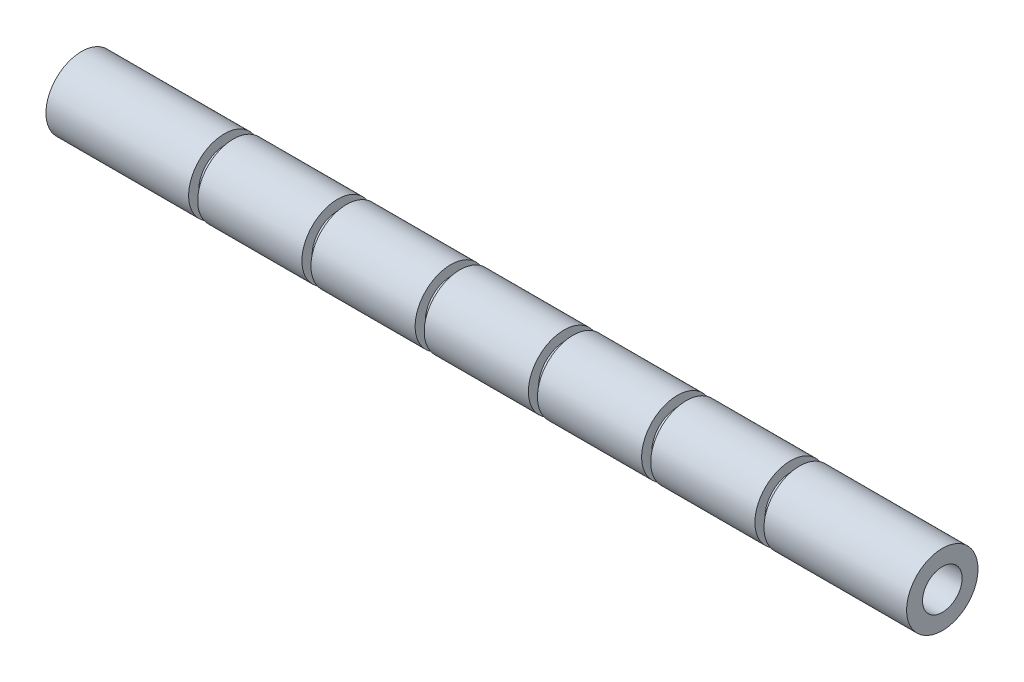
ISO-10303-21;
HEADER;
FILE_DESCRIPTION(('STEP AP214'),'2;1');
FILE_NAME('part.step','',(''),(''),'','','');
FILE_SCHEMA(('AUTOMOTIVE_DESIGN { 1 0 10303 214 1 1 1 1 }'));
ENDSEC;
DATA;
#1=APPLICATION_CONTEXT('core data for automotive mechanical design processes');
#2=APPLICATION_PROTOCOL_DEFINITION('international standard','automotive_design',2000,#1);
#3=PRODUCT_CONTEXT('',#1,'mechanical');
#4=PRODUCT('Part','Part','',(#3));
#5=PRODUCT_RELATED_PRODUCT_CATEGORY('part','',(#4));
#6=PRODUCT_DEFINITION_FORMATION('','',#4);
#7=PRODUCT_DEFINITION_CONTEXT('part definition',#1,'design');
#8=PRODUCT_DEFINITION('design','',#6,#7);
#9=PRODUCT_DEFINITION_SHAPE('','',#8);
#10=(LENGTH_UNIT() NAMED_UNIT(*) SI_UNIT(.MILLI.,.METRE.));
#11=(NAMED_UNIT(*) PLANE_ANGLE_UNIT() SI_UNIT($,.RADIAN.));
#12=(NAMED_UNIT(*) SI_UNIT($,.STERADIAN.) SOLID_ANGLE_UNIT());
#13=UNCERTAINTY_MEASURE_WITH_UNIT(LENGTH_MEASURE(1.E-05),#10,'distance_accuracy_value','');
#14=(GEOMETRIC_REPRESENTATION_CONTEXT(3) GLOBAL_UNCERTAINTY_ASSIGNED_CONTEXT((#13)) GLOBAL_UNIT_ASSIGNED_CONTEXT((#10,
#11,#12)) REPRESENTATION_CONTEXT('',''));
#15=CARTESIAN_POINT('',(0.,0.,0.));
#16=DIRECTION('',(0.,0.,1.));
#17=DIRECTION('',(1.,0.,0.));
#18=AXIS2_PLACEMENT_3D('',#15,#16,#17);
#19=CARTESIAN_POINT('',(380.,0.,0.));
#20=DIRECTION('',(-1.,0.,0.));
#21=DIRECTION('',(0.,0.,1.));
#22=AXIS2_PLACEMENT_3D('',#19,#20,#21);
#23=CYLINDRICAL_SURFACE('',#22,31.5);
#24=CARTESIAN_POINT('',(246.,0.,0.));
#25=DIRECTION('',(1.,0.,0.));
#26=DIRECTION('',(0.,0.,-1.));
#27=AXIS2_PLACEMENT_3D('',#24,#25,#26);
#28=CIRCLE('',#27,31.5);
#29=CARTESIAN_POINT('',(246.,0.,-31.5));
#30=VERTEX_POINT('',#29);
#31=EDGE_CURVE('E154',#30,#30,#28,.T.);
#32=ORIENTED_EDGE('',*,*,#31,.F.);
#33=EDGE_LOOP('',(#32));
#34=FACE_BOUND('',#33,.T.);
#35=CARTESIAN_POINT('',(154.,0.,0.));
#36=DIRECTION('',(1.,0.,0.));
#37=DIRECTION('',(0.,0.,-1.));
#38=AXIS2_PLACEMENT_3D('',#35,#36,#37);
#39=CIRCLE('',#38,31.5);
#40=CARTESIAN_POINT('',(154.,0.,-31.5));
#41=VERTEX_POINT('',#40);
#42=EDGE_CURVE('E134',#41,#41,#39,.T.);
#43=ORIENTED_EDGE('',*,*,#42,.T.);
#44=EDGE_LOOP('',(#43));
#45=FACE_BOUND('',#44,.T.);
#46=ADVANCED_FACE('F38',(#34,#45),#23,.T.);
#47=CARTESIAN_POINT('',(146.,0.,0.));
#48=DIRECTION('',(1.,0.,0.));
#49=DIRECTION('',(0.,0.,-1.));
#50=AXIS2_PLACEMENT_3D('',#47,#48,#49);
#51=CIRCLE('',#50,31.5);
#52=CARTESIAN_POINT('',(146.,0.,-31.5));
#53=VERTEX_POINT('',#52);
#54=EDGE_CURVE('E138',#53,#53,#51,.T.);
#55=ORIENTED_EDGE('',*,*,#54,.F.);
#56=EDGE_LOOP('',(#55));
#57=FACE_BOUND('',#56,.T.);
#58=CARTESIAN_POINT('',(54.,0.,0.));
#59=DIRECTION('',(1.,0.,0.));
#60=DIRECTION('',(0.,0.,-1.));
#61=AXIS2_PLACEMENT_3D('',#58,#59,#60);
#62=CIRCLE('',#61,31.5);
#63=CARTESIAN_POINT('',(54.,0.,-31.5));
#64=VERTEX_POINT('',#63);
#65=EDGE_CURVE('E118',#64,#64,#62,.T.);
#66=ORIENTED_EDGE('',*,*,#65,.T.);
#67=EDGE_LOOP('',(#66));
#68=FACE_BOUND('',#67,.T.);
#69=ADVANCED_FACE('F163',(#57,#68),#23,.T.);
#70=CARTESIAN_POINT('',(46.,0.,0.));
#71=DIRECTION('',(1.,0.,0.));
#72=DIRECTION('',(0.,0.,-1.));
#73=AXIS2_PLACEMENT_3D('',#70,#71,#72);
#74=CIRCLE('',#73,31.5);
#75=CARTESIAN_POINT('',(46.,0.,-31.5));
#76=VERTEX_POINT('',#75);
#77=EDGE_CURVE('E122',#76,#76,#74,.T.);
#78=ORIENTED_EDGE('',*,*,#77,.F.);
#79=EDGE_LOOP('',(#78));
#80=FACE_BOUND('',#79,.T.);
#81=CARTESIAN_POINT('',(-46.,0.,0.));
#82=DIRECTION('',(1.,0.,0.));
#83=DIRECTION('',(0.,0.,-1.));
#84=AXIS2_PLACEMENT_3D('',#81,#82,#83);
#85=CIRCLE('',#84,31.5);
#86=CARTESIAN_POINT('',(-46.,0.,-31.5));
#87=VERTEX_POINT('',#86);
#88=EDGE_CURVE('E103',#87,#87,#85,.T.);
#89=ORIENTED_EDGE('',*,*,#88,.T.);
#90=EDGE_LOOP('',(#89));
#91=FACE_BOUND('',#90,.T.);
#92=ADVANCED_FACE('F187',(#80,#91),#23,.T.);
#93=CARTESIAN_POINT('',(-54.,0.,0.));
#94=DIRECTION('',(1.,0.,0.));
#95=DIRECTION('',(0.,0.,-1.));
#96=AXIS2_PLACEMENT_3D('',#93,#94,#95);
#97=CIRCLE('',#96,31.5);
#98=CARTESIAN_POINT('',(-54.,0.,-31.5));
#99=VERTEX_POINT('',#98);
#100=EDGE_CURVE('E107',#99,#99,#97,.T.);
#101=ORIENTED_EDGE('',*,*,#100,.F.);
#102=EDGE_LOOP('',(#101));
#103=FACE_BOUND('',#102,.T.);
#104=CARTESIAN_POINT('',(-146.,0.,0.));
#105=DIRECTION('',(1.,0.,0.));
#106=DIRECTION('',(0.,0.,-1.));
#107=AXIS2_PLACEMENT_3D('',#104,#105,#106);
#108=CIRCLE('',#107,31.5);
#109=CARTESIAN_POINT('',(-146.,0.,-31.5));
#110=VERTEX_POINT('',#109);
#111=EDGE_CURVE('E88',#110,#110,#108,.T.);
#112=ORIENTED_EDGE('',*,*,#111,.T.);
#113=EDGE_LOOP('',(#112));
#114=FACE_BOUND('',#113,.T.);
#115=ADVANCED_FACE('F210',(#103,#114),#23,.T.);
#116=CARTESIAN_POINT('',(-154.,0.,0.));
#117=DIRECTION('',(1.,0.,0.));
#118=DIRECTION('',(0.,0.,-1.));
#119=AXIS2_PLACEMENT_3D('',#116,#117,#118);
#120=CIRCLE('',#119,31.5);
#121=CARTESIAN_POINT('',(-154.,0.,-31.5));
#122=VERTEX_POINT('',#121);
#123=EDGE_CURVE('E92',#122,#122,#120,.T.);
#124=ORIENTED_EDGE('',*,*,#123,.F.);
#125=EDGE_LOOP('',(#124));
#126=FACE_BOUND('',#125,.T.);
#127=CARTESIAN_POINT('',(-246.,0.,0.));
#128=DIRECTION('',(1.,0.,0.));
#129=DIRECTION('',(0.,0.,-1.));
#130=AXIS2_PLACEMENT_3D('',#127,#128,#129);
#131=CIRCLE('',#130,31.5);
#132=CARTESIAN_POINT('',(-246.,0.,-31.5));
#133=VERTEX_POINT('',#132);
#134=EDGE_CURVE('E73',#133,#133,#131,.T.);
#135=ORIENTED_EDGE('',*,*,#134,.T.);
#136=EDGE_LOOP('',(#135));
#137=FACE_BOUND('',#136,.T.);
#138=ADVANCED_FACE('F233',(#126,#137),#23,.T.);
#139=CARTESIAN_POINT('',(-254.,0.,0.));
#140=DIRECTION('',(1.,0.,0.));
#141=DIRECTION('',(0.,0.,-1.));
#142=AXIS2_PLACEMENT_3D('',#139,#140,#141);
#143=CIRCLE('',#142,31.5);
#144=CARTESIAN_POINT('',(-254.,0.,-31.5));
#145=VERTEX_POINT('',#144);
#146=EDGE_CURVE('E77',#145,#145,#143,.T.);
#147=ORIENTED_EDGE('',*,*,#146,.F.);
#148=EDGE_LOOP('',(#147));
#149=FACE_BOUND('',#148,.T.);
#150=CARTESIAN_POINT('',(-380.,0.,0.));
#151=DIRECTION('',(1.,0.,0.));
#152=DIRECTION('',(0.,0.,-1.));
#153=AXIS2_PLACEMENT_3D('',#150,#151,#152);
#154=CIRCLE('',#153,31.5);
#155=CARTESIAN_POINT('',(-380.,0.,-31.5));
#156=VERTEX_POINT('',#155);
#157=EDGE_CURVE('E46',#156,#156,#154,.T.);
#158=ORIENTED_EDGE('',*,*,#157,.T.);
#159=EDGE_LOOP('',(#158));
#160=FACE_BOUND('',#159,.T.);
#161=ADVANCED_FACE('F256',(#149,#160),#23,.T.);
#162=CARTESIAN_POINT('',(380.,0.,0.));
#163=DIRECTION('',(1.,0.,0.));
#164=DIRECTION('',(0.,0.,-1.));
#165=AXIS2_PLACEMENT_3D('',#162,#163,#164);
#166=PLANE('',#165);
#167=CARTESIAN_POINT('',(380.,0.,0.));
#168=DIRECTION('',(1.,0.,0.));
#169=DIRECTION('',(0.,0.,-1.));
#170=AXIS2_PLACEMENT_3D('',#167,#168,#169);
#171=CIRCLE('',#170,31.5);
#172=CARTESIAN_POINT('',(380.,0.,-31.5));
#173=VERTEX_POINT('',#172);
#174=EDGE_CURVE('E10',#173,#173,#171,.T.);
#175=ORIENTED_EDGE('',*,*,#174,.T.);
#176=EDGE_LOOP('',(#175));
#177=FACE_BOUND('',#176,.T.);
#178=CARTESIAN_POINT('',(380.,0.,0.));
#179=DIRECTION('',(1.,0.,0.));
#180=DIRECTION('',(0.,0.,-1.));
#181=AXIS2_PLACEMENT_3D('',#178,#179,#180);
#182=CIRCLE('',#181,17.5);
#183=CARTESIAN_POINT('',(380.,0.,-17.5));
#184=VERTEX_POINT('',#183);
#185=EDGE_CURVE('E53',#184,#184,#182,.T.);
#186=ORIENTED_EDGE('',*,*,#185,.F.);
#187=EDGE_LOOP('',(#186));
#188=FACE_BOUND('',#187,.T.);
#189=ADVANCED_FACE('F278',(#177,#188),#166,.T.);
#190=CARTESIAN_POINT('',(-380.,0.,0.));
#191=DIRECTION('',(1.,0.,0.));
#192=DIRECTION('',(0.,0.,-1.));
#193=AXIS2_PLACEMENT_3D('',#190,#191,#192);
#194=PLANE('',#193);
#195=ORIENTED_EDGE('',*,*,#157,.F.);
#196=EDGE_LOOP('',(#195));
#197=FACE_BOUND('',#196,.T.);
#198=CARTESIAN_POINT('',(-380.,0.,0.));
#199=DIRECTION('',(1.,0.,0.));
#200=DIRECTION('',(0.,0.,-1.));
#201=AXIS2_PLACEMENT_3D('',#198,#199,#200);
#202=CIRCLE('',#201,17.5);
#203=CARTESIAN_POINT('',(-380.,0.,-17.5));
#204=VERTEX_POINT('',#203);
#205=EDGE_CURVE('E60',#204,#204,#202,.T.);
#206=ORIENTED_EDGE('',*,*,#205,.T.);
#207=EDGE_LOOP('',(#206));
#208=FACE_BOUND('',#207,.T.);
#209=ADVANCED_FACE('F282',(#197,#208),#194,.F.);
#210=CARTESIAN_POINT('',(254.,0.,0.));
#211=DIRECTION('',(1.,0.,0.));
#212=DIRECTION('',(0.,0.,-1.));
#213=AXIS2_PLACEMENT_3D('',#210,#211,#212);
#214=CIRCLE('',#213,31.5);
#215=CARTESIAN_POINT('',(254.,0.,-31.5));
#216=VERTEX_POINT('',#215);
#217=EDGE_CURVE('E150',#216,#216,#214,.T.);
#218=ORIENTED_EDGE('',*,*,#217,.T.);
#219=EDGE_LOOP('',(#218));
#220=FACE_BOUND('',#219,.T.);
#221=ORIENTED_EDGE('',*,*,#174,.F.);
#222=EDGE_LOOP('',(#221));
#223=FACE_BOUND('',#222,.T.);
#224=ADVANCED_FACE('F40',(#220,#223),#23,.T.);
#225=CARTESIAN_POINT('',(380.,0.,0.));
#226=DIRECTION('',(-1.,0.,0.));
#227=DIRECTION('',(0.,0.,1.));
#228=AXIS2_PLACEMENT_3D('',#225,#226,#227);
#229=CYLINDRICAL_SURFACE('',#228,17.5);
#230=ORIENTED_EDGE('',*,*,#185,.T.);
#231=EDGE_LOOP('',(#230));
#232=FACE_BOUND('',#231,.T.);
#233=ORIENTED_EDGE('',*,*,#205,.F.);
#234=EDGE_LOOP('',(#233));
#235=FACE_BOUND('',#234,.T.);
#236=ADVANCED_FACE('F273',(#232,#235),#229,.F.);
#237=CARTESIAN_POINT('',(-254.,31.5,0.));
#238=DIRECTION('',(-1.,0.,0.));
#239=DIRECTION('',(0.,0.,1.));
#240=AXIS2_PLACEMENT_3D('',#237,#238,#239);
#241=PLANE('',#240);
#242=CARTESIAN_POINT('',(-254.,0.,0.));
#243=DIRECTION('',(1.,0.,0.));
#244=DIRECTION('',(0.,0.,-1.));
#245=AXIS2_PLACEMENT_3D('',#242,#243,#244);
#246=CIRCLE('',#245,22.5);
#247=CARTESIAN_POINT('',(-254.,0.,-22.5));
#248=VERTEX_POINT('',#247);
#249=EDGE_CURVE('E65',#248,#248,#246,.T.);
#250=ORIENTED_EDGE('',*,*,#249,.F.);
#251=EDGE_LOOP('',(#250));
#252=FACE_BOUND('',#251,.T.);
#253=ORIENTED_EDGE('',*,*,#146,.T.);
#254=EDGE_LOOP('',(#253));
#255=FACE_BOUND('',#254,.T.);
#256=ADVANCED_FACE('F267',(#252,#255),#241,.F.);
#257=CARTESIAN_POINT('',(0.,0.,0.));
#258=DIRECTION('',(1.,0.,0.));
#259=DIRECTION('',(0.,0.,-1.));
#260=AXIS2_PLACEMENT_3D('',#257,#258,#259);
#261=CYLINDRICAL_SURFACE('',#260,22.5);
#262=CARTESIAN_POINT('',(-246.,0.,0.));
#263=DIRECTION('',(1.,0.,0.));
#264=DIRECTION('',(0.,0.,-1.));
#265=AXIS2_PLACEMENT_3D('',#262,#263,#264);
#266=CIRCLE('',#265,22.5);
#267=CARTESIAN_POINT('',(-246.,0.,-22.5));
#268=VERTEX_POINT('',#267);
#269=EDGE_CURVE('E69',#268,#268,#266,.T.);
#270=ORIENTED_EDGE('',*,*,#269,.F.);
#271=EDGE_LOOP('',(#270));
#272=FACE_BOUND('',#271,.T.);
#273=ORIENTED_EDGE('',*,*,#249,.T.);
#274=EDGE_LOOP('',(#273));
#275=FACE_BOUND('',#274,.T.);
#276=ADVANCED_FACE('F261',(#272,#275),#261,.T.);
#277=CARTESIAN_POINT('',(-246.,31.5,0.));
#278=DIRECTION('',(1.,0.,0.));
#279=DIRECTION('',(0.,0.,-1.));
#280=AXIS2_PLACEMENT_3D('',#277,#278,#279);
#281=PLANE('',#280);
#282=ORIENTED_EDGE('',*,*,#134,.F.);
#283=EDGE_LOOP('',(#282));
#284=FACE_BOUND('',#283,.T.);
#285=ORIENTED_EDGE('',*,*,#269,.T.);
#286=EDGE_LOOP('',(#285));
#287=FACE_BOUND('',#286,.T.);
#288=ADVANCED_FACE('F250',(#284,#287),#281,.F.);
#289=CARTESIAN_POINT('',(-154.,31.5,0.));
#290=DIRECTION('',(-1.,0.,0.));
#291=DIRECTION('',(0.,0.,1.));
#292=AXIS2_PLACEMENT_3D('',#289,#290,#291);
#293=PLANE('',#292);
#294=CARTESIAN_POINT('',(-154.,0.,0.));
#295=DIRECTION('',(1.,0.,0.));
#296=DIRECTION('',(0.,0.,-1.));
#297=AXIS2_PLACEMENT_3D('',#294,#295,#296);
#298=CIRCLE('',#297,22.5);
#299=CARTESIAN_POINT('',(-154.,0.,-22.5));
#300=VERTEX_POINT('',#299);
#301=EDGE_CURVE('E81',#300,#300,#298,.T.);
#302=ORIENTED_EDGE('',*,*,#301,.F.);
#303=EDGE_LOOP('',(#302));
#304=FACE_BOUND('',#303,.T.);
#305=ORIENTED_EDGE('',*,*,#123,.T.);
#306=EDGE_LOOP('',(#305));
#307=FACE_BOUND('',#306,.T.);
#308=ADVANCED_FACE('F244',(#304,#307),#293,.F.);
#309=CARTESIAN_POINT('',(100.,0.,0.));
#310=DIRECTION('',(1.,0.,0.));
#311=DIRECTION('',(0.,0.,-1.));
#312=AXIS2_PLACEMENT_3D('',#309,#310,#311);
#313=CYLINDRICAL_SURFACE('',#312,22.5);
#314=CARTESIAN_POINT('',(-146.,0.,0.));
#315=DIRECTION('',(1.,0.,0.));
#316=DIRECTION('',(0.,0.,-1.));
#317=AXIS2_PLACEMENT_3D('',#314,#315,#316);
#318=CIRCLE('',#317,22.5);
#319=CARTESIAN_POINT('',(-146.,0.,-22.5));
#320=VERTEX_POINT('',#319);
#321=EDGE_CURVE('E85',#320,#320,#318,.T.);
#322=ORIENTED_EDGE('',*,*,#321,.F.);
#323=EDGE_LOOP('',(#322));
#324=FACE_BOUND('',#323,.T.);
#325=ORIENTED_EDGE('',*,*,#301,.T.);
#326=EDGE_LOOP('',(#325));
#327=FACE_BOUND('',#326,.T.);
#328=ADVANCED_FACE('F238',(#324,#327),#313,.T.);
#329=CARTESIAN_POINT('',(-146.,31.5,0.));
#330=DIRECTION('',(1.,0.,0.));
#331=DIRECTION('',(0.,0.,-1.));
#332=AXIS2_PLACEMENT_3D('',#329,#330,#331);
#333=PLANE('',#332);
#334=ORIENTED_EDGE('',*,*,#111,.F.);
#335=EDGE_LOOP('',(#334));
#336=FACE_BOUND('',#335,.T.);
#337=ORIENTED_EDGE('',*,*,#321,.T.);
#338=EDGE_LOOP('',(#337));
#339=FACE_BOUND('',#338,.T.);
#340=ADVANCED_FACE('F227',(#336,#339),#333,.F.);
#341=CARTESIAN_POINT('',(-54.,31.5,0.));
#342=DIRECTION('',(-1.,0.,0.));
#343=DIRECTION('',(0.,0.,1.));
#344=AXIS2_PLACEMENT_3D('',#341,#342,#343);
#345=PLANE('',#344);
#346=CARTESIAN_POINT('',(-54.,0.,0.));
#347=DIRECTION('',(1.,0.,0.));
#348=DIRECTION('',(0.,0.,-1.));
#349=AXIS2_PLACEMENT_3D('',#346,#347,#348);
#350=CIRCLE('',#349,22.5);
#351=CARTESIAN_POINT('',(-54.,0.,-22.5));
#352=VERTEX_POINT('',#351);
#353=EDGE_CURVE('E95',#352,#352,#350,.T.);
#354=ORIENTED_EDGE('',*,*,#353,.F.);
#355=EDGE_LOOP('',(#354));
#356=FACE_BOUND('',#355,.T.);
#357=ORIENTED_EDGE('',*,*,#100,.T.);
#358=EDGE_LOOP('',(#357));
#359=FACE_BOUND('',#358,.T.);
#360=ADVANCED_FACE('F221',(#356,#359),#345,.F.);
#361=CARTESIAN_POINT('',(200.,0.,0.));
#362=DIRECTION('',(1.,0.,0.));
#363=DIRECTION('',(0.,0.,-1.));
#364=AXIS2_PLACEMENT_3D('',#361,#362,#363);
#365=CYLINDRICAL_SURFACE('',#364,22.5);
#366=CARTESIAN_POINT('',(-46.,0.,0.));
#367=DIRECTION('',(1.,0.,0.));
#368=DIRECTION('',(0.,0.,-1.));
#369=AXIS2_PLACEMENT_3D('',#366,#367,#368);
#370=CIRCLE('',#369,22.5);
#371=CARTESIAN_POINT('',(-46.,0.,-22.5));
#372=VERTEX_POINT('',#371);
#373=EDGE_CURVE('E99',#372,#372,#370,.T.);
#374=ORIENTED_EDGE('',*,*,#373,.F.);
#375=EDGE_LOOP('',(#374));
#376=FACE_BOUND('',#375,.T.);
#377=ORIENTED_EDGE('',*,*,#353,.T.);
#378=EDGE_LOOP('',(#377));
#379=FACE_BOUND('',#378,.T.);
#380=ADVANCED_FACE('F215',(#376,#379),#365,.T.);
#381=CARTESIAN_POINT('',(-46.,31.5,0.));
#382=DIRECTION('',(1.,0.,0.));
#383=DIRECTION('',(0.,0.,-1.));
#384=AXIS2_PLACEMENT_3D('',#381,#382,#383);
#385=PLANE('',#384);
#386=ORIENTED_EDGE('',*,*,#88,.F.);
#387=EDGE_LOOP('',(#386));
#388=FACE_BOUND('',#387,.T.);
#389=ORIENTED_EDGE('',*,*,#373,.T.);
#390=EDGE_LOOP('',(#389));
#391=FACE_BOUND('',#390,.T.);
#392=ADVANCED_FACE('F204',(#388,#391),#385,.F.);
#393=CARTESIAN_POINT('',(46.,31.5,0.));
#394=DIRECTION('',(-1.,0.,0.));
#395=DIRECTION('',(0.,0.,1.));
#396=AXIS2_PLACEMENT_3D('',#393,#394,#395);
#397=PLANE('',#396);
#398=CARTESIAN_POINT('',(46.,0.,0.));
#399=DIRECTION('',(1.,0.,0.));
#400=DIRECTION('',(0.,0.,-1.));
#401=AXIS2_PLACEMENT_3D('',#398,#399,#400);
#402=CIRCLE('',#401,22.5);
#403=CARTESIAN_POINT('',(46.,0.,-22.5));
#404=VERTEX_POINT('',#403);
#405=EDGE_CURVE('E111',#404,#404,#402,.T.);
#406=ORIENTED_EDGE('',*,*,#405,.F.);
#407=EDGE_LOOP('',(#406));
#408=FACE_BOUND('',#407,.T.);
#409=ORIENTED_EDGE('',*,*,#77,.T.);
#410=EDGE_LOOP('',(#409));
#411=FACE_BOUND('',#410,.T.);
#412=ADVANCED_FACE('F198',(#408,#411),#397,.F.);
#413=CARTESIAN_POINT('',(300.,0.,0.));
#414=DIRECTION('',(1.,0.,0.));
#415=DIRECTION('',(0.,0.,-1.));
#416=AXIS2_PLACEMENT_3D('',#413,#414,#415);
#417=CYLINDRICAL_SURFACE('',#416,22.5);
#418=CARTESIAN_POINT('',(54.,0.,0.));
#419=DIRECTION('',(1.,0.,0.));
#420=DIRECTION('',(0.,0.,-1.));
#421=AXIS2_PLACEMENT_3D('',#418,#419,#420);
#422=CIRCLE('',#421,22.5);
#423=CARTESIAN_POINT('',(54.,0.,-22.5));
#424=VERTEX_POINT('',#423);
#425=EDGE_CURVE('E115',#424,#424,#422,.T.);
#426=ORIENTED_EDGE('',*,*,#425,.F.);
#427=EDGE_LOOP('',(#426));
#428=FACE_BOUND('',#427,.T.);
#429=ORIENTED_EDGE('',*,*,#405,.T.);
#430=EDGE_LOOP('',(#429));
#431=FACE_BOUND('',#430,.T.);
#432=ADVANCED_FACE('F192',(#428,#431),#417,.T.);
#433=CARTESIAN_POINT('',(54.,31.5,0.));
#434=DIRECTION('',(1.,0.,0.));
#435=DIRECTION('',(0.,0.,-1.));
#436=AXIS2_PLACEMENT_3D('',#433,#434,#435);
#437=PLANE('',#436);
#438=ORIENTED_EDGE('',*,*,#65,.F.);
#439=EDGE_LOOP('',(#438));
#440=FACE_BOUND('',#439,.T.);
#441=ORIENTED_EDGE('',*,*,#425,.T.);
#442=EDGE_LOOP('',(#441));
#443=FACE_BOUND('',#442,.T.);
#444=ADVANCED_FACE('F181',(#440,#443),#437,.F.);
#445=CARTESIAN_POINT('',(146.,31.5,0.));
#446=DIRECTION('',(-1.,0.,0.));
#447=DIRECTION('',(0.,0.,1.));
#448=AXIS2_PLACEMENT_3D('',#445,#446,#447);
#449=PLANE('',#448);
#450=CARTESIAN_POINT('',(146.,0.,0.));
#451=DIRECTION('',(1.,0.,0.));
#452=DIRECTION('',(0.,0.,-1.));
#453=AXIS2_PLACEMENT_3D('',#450,#451,#452);
#454=CIRCLE('',#453,22.5);
#455=CARTESIAN_POINT('',(146.,0.,-22.5));
#456=VERTEX_POINT('',#455);
#457=EDGE_CURVE('E126',#456,#456,#454,.T.);
#458=ORIENTED_EDGE('',*,*,#457,.F.);
#459=EDGE_LOOP('',(#458));
#460=FACE_BOUND('',#459,.T.);
#461=ORIENTED_EDGE('',*,*,#54,.T.);
#462=EDGE_LOOP('',(#461));
#463=FACE_BOUND('',#462,.T.);
#464=ADVANCED_FACE('F175',(#460,#463),#449,.F.);
#465=CARTESIAN_POINT('',(400.,0.,0.));
#466=DIRECTION('',(1.,0.,0.));
#467=DIRECTION('',(0.,0.,-1.));
#468=AXIS2_PLACEMENT_3D('',#465,#466,#467);
#469=CYLINDRICAL_SURFACE('',#468,22.5);
#470=CARTESIAN_POINT('',(154.,0.,0.));
#471=DIRECTION('',(1.,0.,0.));
#472=DIRECTION('',(0.,0.,-1.));
#473=AXIS2_PLACEMENT_3D('',#470,#471,#472);
#474=CIRCLE('',#473,22.5);
#475=CARTESIAN_POINT('',(154.,0.,-22.5));
#476=VERTEX_POINT('',#475);
#477=EDGE_CURVE('E130',#476,#476,#474,.T.);
#478=ORIENTED_EDGE('',*,*,#477,.F.);
#479=EDGE_LOOP('',(#478));
#480=FACE_BOUND('',#479,.T.);
#481=ORIENTED_EDGE('',*,*,#457,.T.);
#482=EDGE_LOOP('',(#481));
#483=FACE_BOUND('',#482,.T.);
#484=ADVANCED_FACE('F169',(#480,#483),#469,.T.);
#485=CARTESIAN_POINT('',(154.,31.5,0.));
#486=DIRECTION('',(1.,0.,0.));
#487=DIRECTION('',(0.,0.,-1.));
#488=AXIS2_PLACEMENT_3D('',#485,#486,#487);
#489=PLANE('',#488);
#490=ORIENTED_EDGE('',*,*,#42,.F.);
#491=EDGE_LOOP('',(#490));
#492=FACE_BOUND('',#491,.T.);
#493=ORIENTED_EDGE('',*,*,#477,.T.);
#494=EDGE_LOOP('',(#493));
#495=FACE_BOUND('',#494,.T.);
#496=ADVANCED_FACE('F166',(#492,#495),#489,.F.);
#497=CARTESIAN_POINT('',(246.,31.5,0.));
#498=DIRECTION('',(-1.,0.,0.));
#499=DIRECTION('',(0.,0.,1.));
#500=AXIS2_PLACEMENT_3D('',#497,#498,#499);
#501=PLANE('',#500);
#502=CARTESIAN_POINT('',(246.,0.,0.));
#503=DIRECTION('',(1.,0.,0.));
#504=DIRECTION('',(0.,0.,-1.));
#505=AXIS2_PLACEMENT_3D('',#502,#503,#504);
#506=CIRCLE('',#505,22.5);
#507=CARTESIAN_POINT('',(246.,0.,-22.5));
#508=VERTEX_POINT('',#507);
#509=EDGE_CURVE('E142',#508,#508,#506,.T.);
#510=ORIENTED_EDGE('',*,*,#509,.F.);
#511=EDGE_LOOP('',(#510));
#512=FACE_BOUND('',#511,.T.);
#513=ORIENTED_EDGE('',*,*,#31,.T.);
#514=EDGE_LOOP('',(#513));
#515=FACE_BOUND('',#514,.T.);
#516=ADVANCED_FACE('F159',(#512,#515),#501,.F.);
#517=CARTESIAN_POINT('',(500.,0.,0.));
#518=DIRECTION('',(1.,0.,0.));
#519=DIRECTION('',(0.,0.,-1.));
#520=AXIS2_PLACEMENT_3D('',#517,#518,#519);
#521=CYLINDRICAL_SURFACE('',#520,22.5);
#522=CARTESIAN_POINT('',(254.,0.,0.));
#523=DIRECTION('',(1.,0.,0.));
#524=DIRECTION('',(0.,0.,-1.));
#525=AXIS2_PLACEMENT_3D('',#522,#523,#524);
#526=CIRCLE('',#525,22.5);
#527=CARTESIAN_POINT('',(254.,0.,-22.5));
#528=VERTEX_POINT('',#527);
#529=EDGE_CURVE('E146',#528,#528,#526,.T.);
#530=ORIENTED_EDGE('',*,*,#529,.F.);
#531=EDGE_LOOP('',(#530));
#532=FACE_BOUND('',#531,.T.);
#533=ORIENTED_EDGE('',*,*,#509,.T.);
#534=EDGE_LOOP('',(#533));
#535=FACE_BOUND('',#534,.T.);
#536=ADVANCED_FACE('F299',(#532,#535),#521,.T.);
#537=CARTESIAN_POINT('',(254.,31.5,0.));
#538=DIRECTION('',(1.,0.,0.));
#539=DIRECTION('',(0.,0.,-1.));
#540=AXIS2_PLACEMENT_3D('',#537,#538,#539);
#541=PLANE('',#540);
#542=ORIENTED_EDGE('',*,*,#217,.F.);
#543=EDGE_LOOP('',(#542));
#544=FACE_BOUND('',#543,.T.);
#545=ORIENTED_EDGE('',*,*,#529,.T.);
#546=EDGE_LOOP('',(#545));
#547=FACE_BOUND('',#546,.T.);
#548=ADVANCED_FACE('F296',(#544,#547),#541,.F.);
#549=CLOSED_SHELL('',(#46,#69,#92,#115,#138,#161,#189,#209,#224,#236,#256,#276,#288,#308,#328,
#340,#360,#380,#392,#412,#432,#444,#464,#484,#496,#516,#536,#548));
#550=MANIFOLD_SOLID_BREP('B2',#549);
#551=ADVANCED_BREP_SHAPE_REPRESENTATION('',(#18,#550),#14);
#552=SHAPE_DEFINITION_REPRESENTATION(#9,#551);
ENDSEC;
END-ISO-10303-21;
